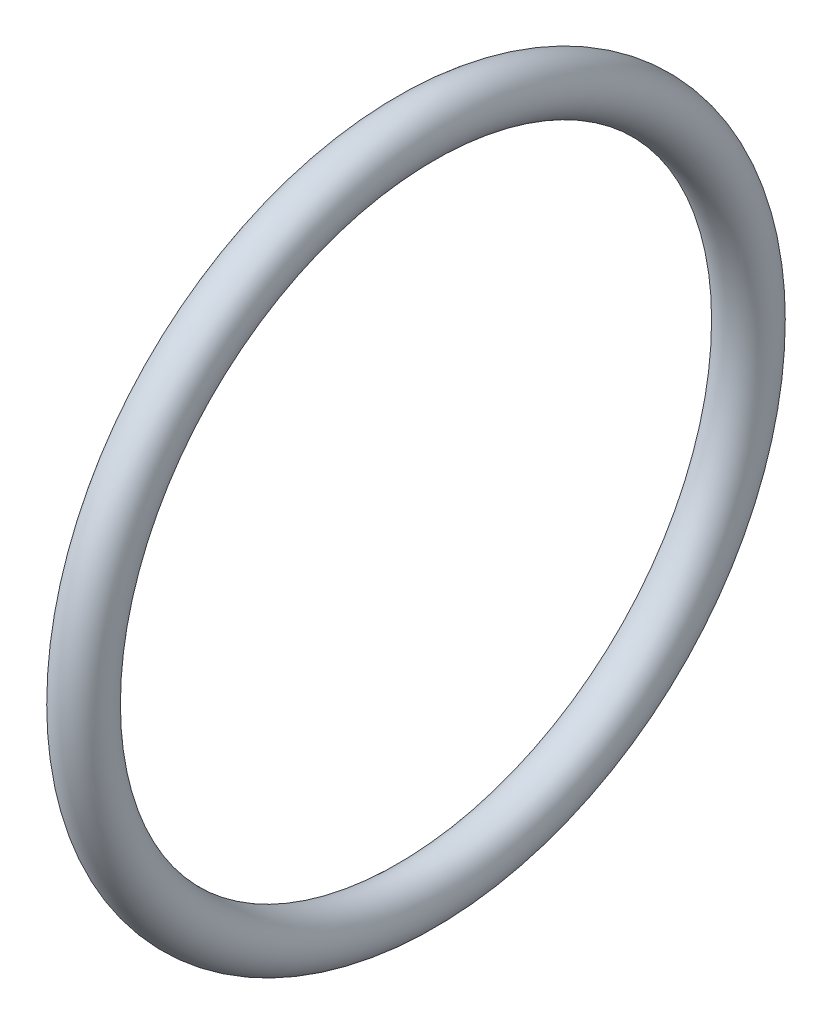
ISO-10303-21;
HEADER;
FILE_DESCRIPTION(('STEP AP214'),'2;1');
FILE_NAME('part.step','',(''),(''),'','','');
FILE_SCHEMA(('AUTOMOTIVE_DESIGN { 1 0 10303 214 1 1 1 1 }'));
ENDSEC;
DATA;
#1=APPLICATION_CONTEXT('core data for automotive mechanical design processes');
#2=APPLICATION_PROTOCOL_DEFINITION('international standard','automotive_design',2000,#1);
#3=PRODUCT_CONTEXT('',#1,'mechanical');
#4=PRODUCT('Part','Part','',(#3));
#5=PRODUCT_RELATED_PRODUCT_CATEGORY('part','',(#4));
#6=PRODUCT_DEFINITION_FORMATION('','',#4);
#7=PRODUCT_DEFINITION_CONTEXT('part definition',#1,'design');
#8=PRODUCT_DEFINITION('design','',#6,#7);
#9=PRODUCT_DEFINITION_SHAPE('','',#8);
#10=(LENGTH_UNIT() NAMED_UNIT(*) SI_UNIT(.MILLI.,.METRE.));
#11=(NAMED_UNIT(*) PLANE_ANGLE_UNIT() SI_UNIT($,.RADIAN.));
#12=(NAMED_UNIT(*) SI_UNIT($,.STERADIAN.) SOLID_ANGLE_UNIT());
#13=UNCERTAINTY_MEASURE_WITH_UNIT(LENGTH_MEASURE(1.E-05),#10,'distance_accuracy_value','');
#14=(GEOMETRIC_REPRESENTATION_CONTEXT(3) GLOBAL_UNCERTAINTY_ASSIGNED_CONTEXT((#13)) GLOBAL_UNIT_ASSIGNED_CONTEXT((#10,
#11,#12)) REPRESENTATION_CONTEXT('',''));
#15=CARTESIAN_POINT('',(0.,0.,0.));
#16=DIRECTION('',(0.,0.,1.));
#17=DIRECTION('',(1.,0.,0.));
#18=AXIS2_PLACEMENT_3D('',#15,#16,#17);
#19=CARTESIAN_POINT('',(0.,0.,0.));
#20=DIRECTION('',(-1.,0.,0.));
#21=DIRECTION('',(0.,0.,1.));
#22=AXIS2_PLACEMENT_3D('',#19,#20,#21);
#23=TOROIDAL_SURFACE('',#22,25.5,2.);
#24=CARTESIAN_POINT('',(0.,0.,27.5));
#25=VERTEX_POINT('',#24);
#26=VERTEX_LOOP('',#25);
#27=FACE_BOUND('',#26,.T.);
#28=ADVANCED_FACE('F29',(#27),#23,.T.);
#29=CLOSED_SHELL('',(#28));
#30=MANIFOLD_SOLID_BREP('B2',#29);
#31=ADVANCED_BREP_SHAPE_REPRESENTATION('',(#18,#30),#14);
#32=SHAPE_DEFINITION_REPRESENTATION(#9,#31);
ENDSEC;
END-ISO-10303-21;
